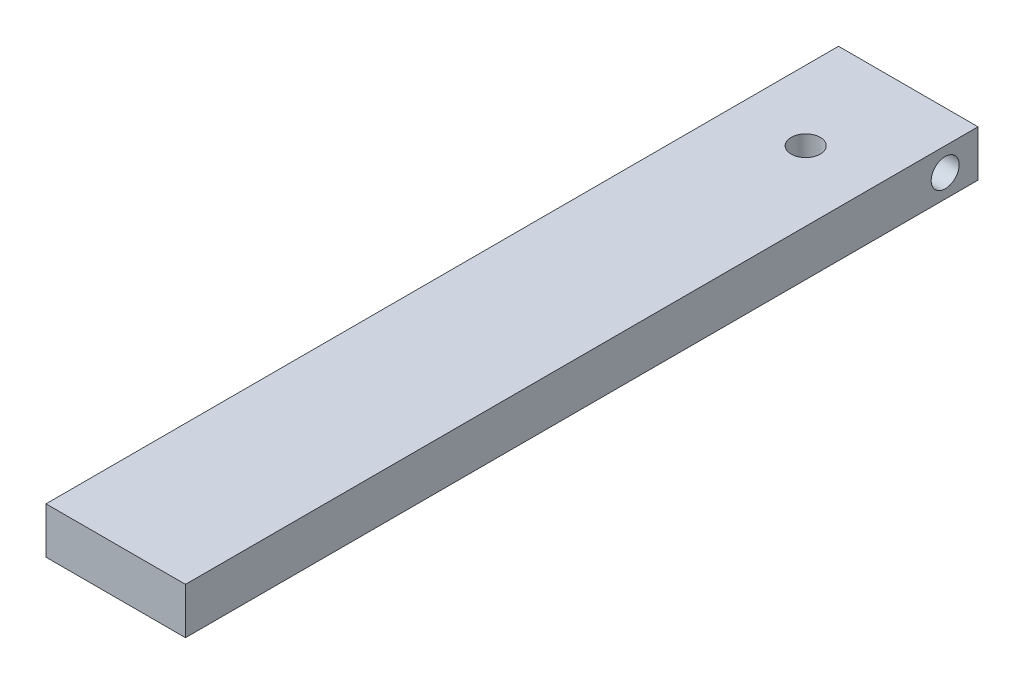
from build123d import *

# Parameters (mm, degrees)
SKETCH1_W          = 18.9992
SKETCH1_H          = 6.2992
BASE_EXTRUDE_DEPTH = 107.95
SKETCH2_R          = 1.9812
CUT_EXTRUDE1_DEPTH = 109.550102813
SKETCH3_R          = 1.905
CUT_EXTRUDE2_DEPTH = 110.790036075
SKETCH4_R          = 2.3749
CUT_EXTRUDE3_DEPTH = 9.525


with BuildPart() as part:
    # Sketch1 → Base-Extrude (new body)
    with BuildSketch(Plane.XY):
        with Locations((0, -3.1496)):
            Rectangle(SKETCH1_W, SKETCH1_H)
    extrude(amount=BASE_EXTRUDE_DEPTH)

    # Sketch2 → Cut-Extrude1 (cut, through all)
    with BuildSketch(Plane(origin=(0, 0, 0), x_dir=(-1, 0, 0), z_dir=(0, 1, 0))):
        with Locations((0, 13.97)):
            Circle(SKETCH2_R)
    extrude(amount=-CUT_EXTRUDE1_DEPTH, mode=Mode.SUBTRACT)

    # Sketch3 → Cut-Extrude2 (cut, through all)
    with BuildSketch(Plane(origin=(9.4996, 0, 0), x_dir=(0, 0, -1), z_dir=(1, 0, 0))):
        with Locations(Location((-4.4704, -3.175, 0), (0, 0, 90))):
            Circle(SKETCH3_R)
    extrude(amount=-CUT_EXTRUDE2_DEPTH, mode=Mode.SUBTRACT)

    # Sketch4 → Cut-Extrude3 (cut)
    with BuildSketch(Plane(origin=(0, 0, 0), x_dir=(-1, 0, 0), z_dir=(0, 0, -1))):
        with Locations((0, -3.175)):
            Circle(SKETCH4_R)
    extrude(amount=-CUT_EXTRUDE3_DEPTH, mode=Mode.SUBTRACT)


solid = part.part
